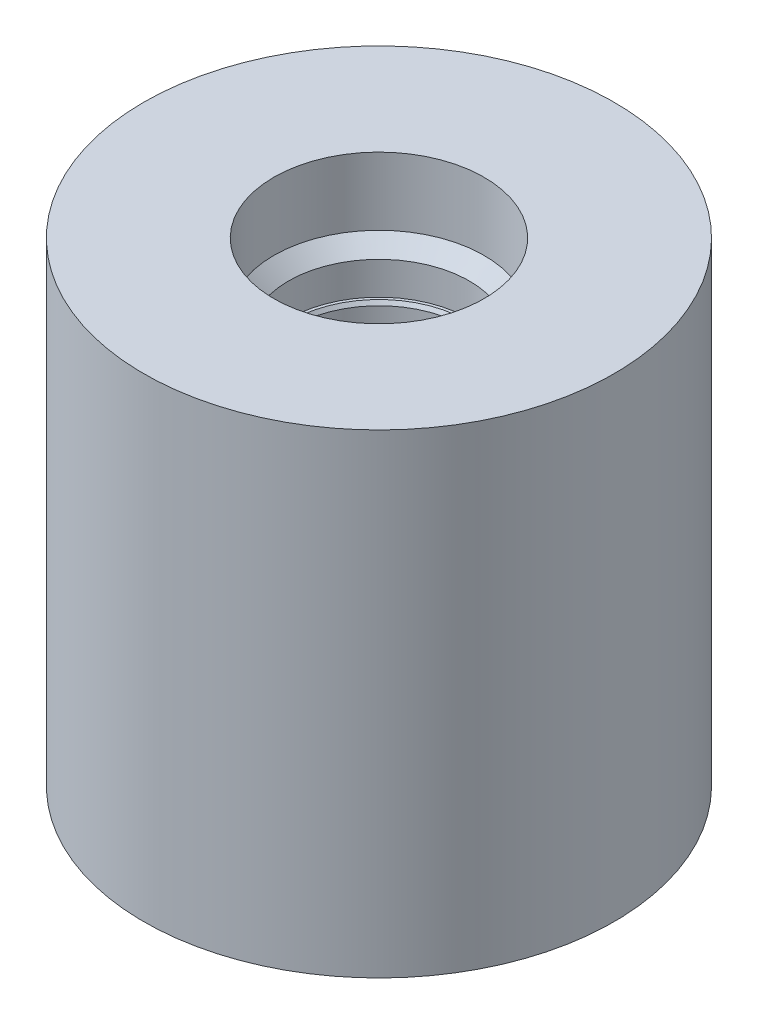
from build123d import *


with BuildPart() as part:
    # Skizze1 → Rotation9 (revolve)
    with BuildSketch(Plane.XY):
        Polygon((5.301622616, 599.252899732), (3.436004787, 599.252899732), (3.309074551, 599.379926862), (3.309074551, 606.403093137), (2.750193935, 606.961876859), (2.750193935, 634.139869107), (1.734170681, 635.155892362), (1.734170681, 638.656356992), (1.46752029, 639.118247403), (1.124614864, 639.118247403), (1.124614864, 643.080699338), (-0.653377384, 644.858691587), (-0.653377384, 653.03600253), (-16.352325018, 653.03600253), (-16.352325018, 595.722591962), (5.301622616, 595.722591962), align=None)
    revolve(axis=Axis((12.046622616, 653.03600253, 0), (0, -1, 0)))


solid = part.part
